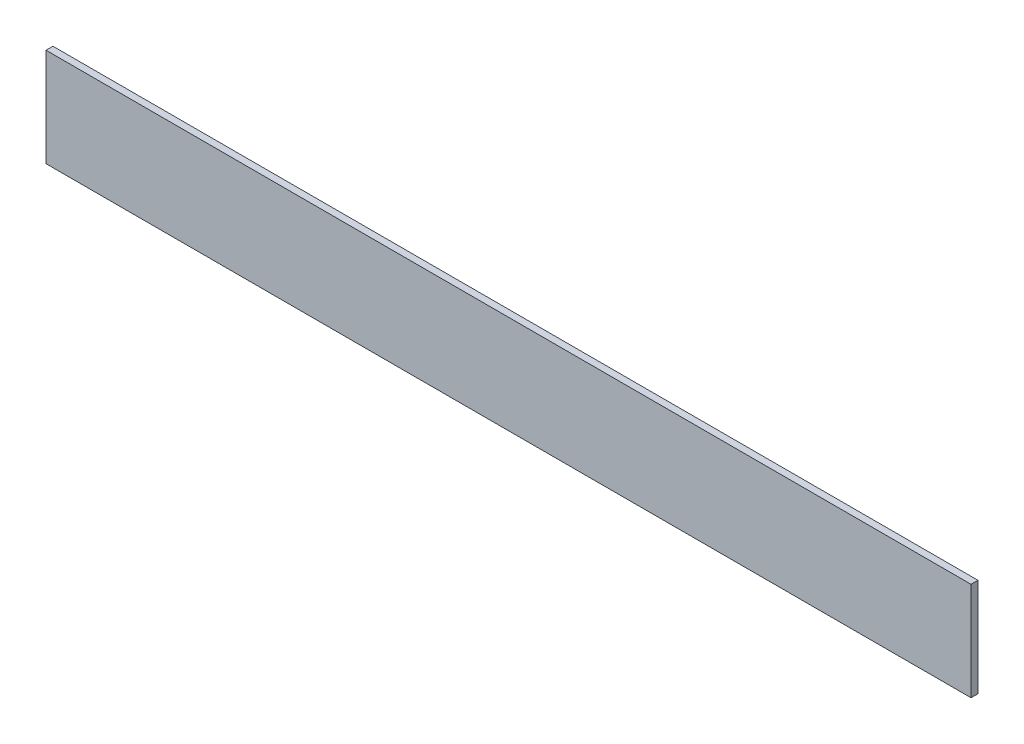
from build123d import *

# Parameters (mm, degrees)
ESQUISSE1_W          = 800
ESQUISSE1_H          = 85
BASE_EXTRUSION_DEPTH = 6


with BuildPart() as part:
    # Esquisse1 → Base-Extrusion (new body)
    with BuildSketch(Plane.XY):
        with Locations((0, -7.750489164)):
            Rectangle(ESQUISSE1_W, ESQUISSE1_H)
    extrude(amount=BASE_EXTRUSION_DEPTH)


solid = part.part
